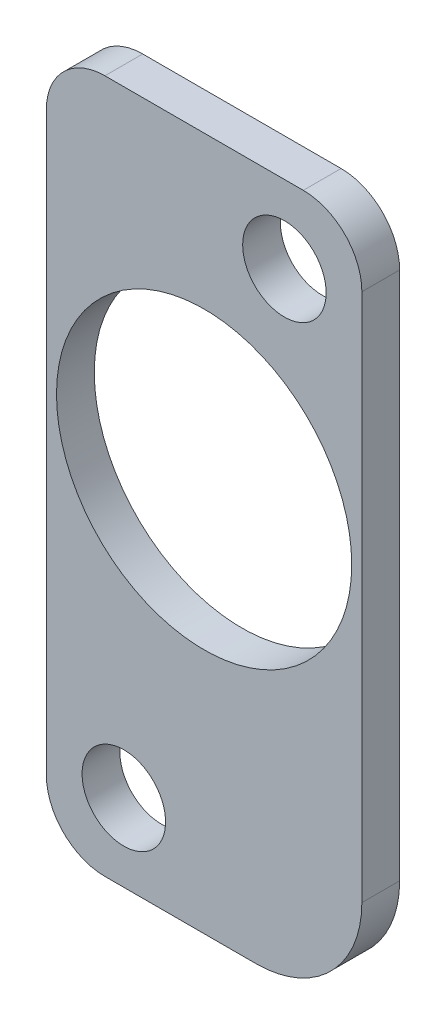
from build123d import *

# Parameters (mm, degrees)
SKETCH1_R           = 2.8067
SKETCH1_R_2         = 9.921875
BOSS_EXTRUDE1_DEPTH = 2.54


with BuildPart() as part:
    # Sketch1 → Boss-Extrude1 (new body)
    with BuildSketch(Plane(origin=(0, 0, -31.75), x_dir=(-1, 0, 0), z_dir=(0, 0, -1))):
        with BuildLine():
            Line((750.474295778, -14.723872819), (750.474295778, -50.283872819))
            ThreePointArc((750.474295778, -50.283872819), (752.557352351, -55.312816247), (757.586295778, -57.395872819))
            Line((757.586295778, -57.395872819), (767.746295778, -57.395872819))
            ThreePointArc((767.746295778, -57.395872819), (770.530175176, -56.242752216), (771.683295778, -53.458872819))
            Line((771.683295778, -53.458872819), (771.683295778, -14.723872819))
            ThreePointArc((771.683295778, -14.723872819), (770.530175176, -11.939993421), (767.746295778, -10.786872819))
            Line((767.746295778, -10.786872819), (754.411295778, -10.786872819))
            ThreePointArc((754.411295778, -10.786872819), (751.627416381, -11.939993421), (750.474295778, -14.723872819))
        make_face()
        with Locations((755.681295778, -15.993872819)):
            Circle(SKETCH1_R, mode=Mode.SUBTRACT)
        with Locations((766.476295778, -52.188872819)):
            Circle(SKETCH1_R, mode=Mode.SUBTRACT)
        with Locations((761.078795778, -30.950406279)):
            Circle(SKETCH1_R_2, mode=Mode.SUBTRACT)
    extrude(amount=-BOSS_EXTRUDE1_DEPTH)


solid = part.part
